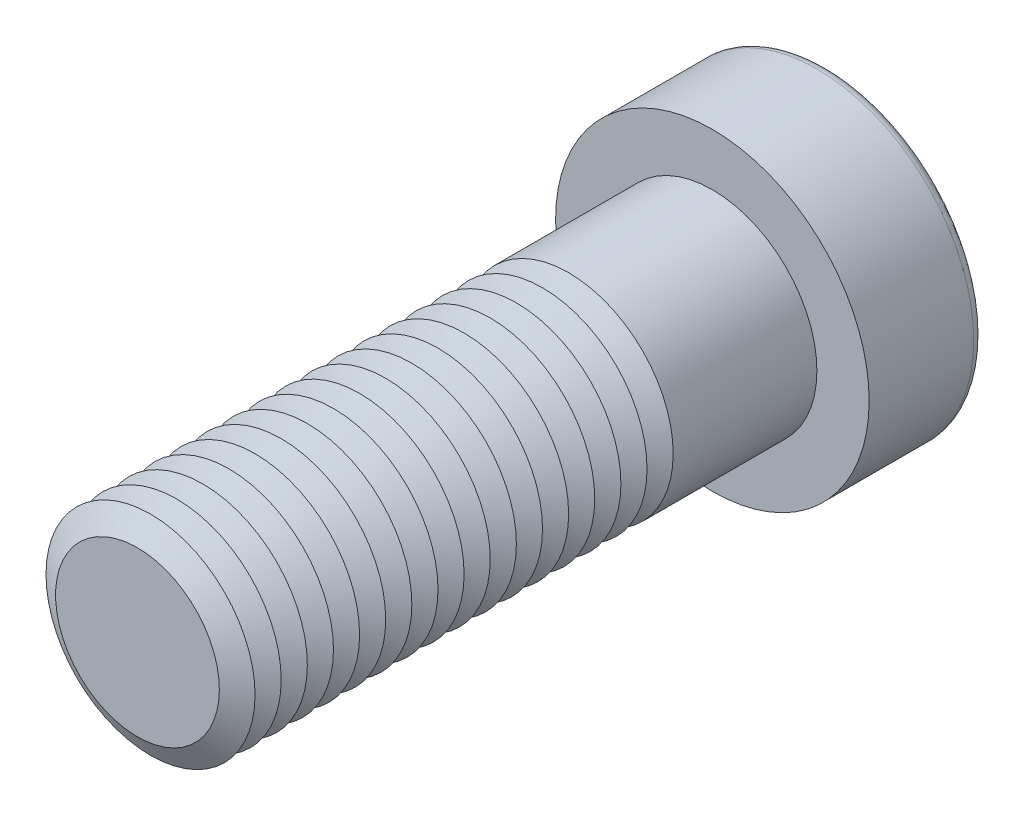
ISO-10303-21;
HEADER;
FILE_DESCRIPTION(('STEP AP214'),'2;1');
FILE_NAME('part.step','',(''),(''),'','','');
FILE_SCHEMA(('AUTOMOTIVE_DESIGN { 1 0 10303 214 1 1 1 1 }'));
ENDSEC;
DATA;
#1=APPLICATION_CONTEXT('core data for automotive mechanical design processes');
#2=APPLICATION_PROTOCOL_DEFINITION('international standard','automotive_design',2000,#1);
#3=PRODUCT_CONTEXT('',#1,'mechanical');
#4=PRODUCT('Part','Part','',(#3));
#5=PRODUCT_RELATED_PRODUCT_CATEGORY('part','',(#4));
#6=PRODUCT_DEFINITION_FORMATION('','',#4);
#7=PRODUCT_DEFINITION_CONTEXT('part definition',#1,'design');
#8=PRODUCT_DEFINITION('design','',#6,#7);
#9=PRODUCT_DEFINITION_SHAPE('','',#8);
#10=(LENGTH_UNIT() NAMED_UNIT(*) SI_UNIT(.MILLI.,.METRE.));
#11=(NAMED_UNIT(*) PLANE_ANGLE_UNIT() SI_UNIT($,.RADIAN.));
#12=(NAMED_UNIT(*) SI_UNIT($,.STERADIAN.) SOLID_ANGLE_UNIT());
#13=UNCERTAINTY_MEASURE_WITH_UNIT(LENGTH_MEASURE(1.E-05),#10,'distance_accuracy_value','');
#14=(GEOMETRIC_REPRESENTATION_CONTEXT(3) GLOBAL_UNCERTAINTY_ASSIGNED_CONTEXT((#13)) GLOBAL_UNIT_ASSIGNED_CONTEXT((#10,
#11,#12)) REPRESENTATION_CONTEXT('',''));
#15=CARTESIAN_POINT('',(0.,0.,0.));
#16=DIRECTION('',(0.,0.,1.));
#17=DIRECTION('',(1.,0.,0.));
#18=AXIS2_PLACEMENT_3D('',#15,#16,#17);
#19=CARTESIAN_POINT('',(0.,0.,46.25));
#20=DIRECTION('',(0.,0.,1.));
#21=DIRECTION('',(1.,0.,0.));
#22=AXIS2_PLACEMENT_3D('',#19,#20,#21);
#23=CONICAL_SURFACE('',#22,10.,1.0471975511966);
#24=CARTESIAN_POINT('',(0.,0.,45.));
#25=DIRECTION('',(0.,0.,1.));
#26=DIRECTION('',(1.,0.,0.));
#27=AXIS2_PLACEMENT_3D('',#24,#25,#26);
#28=CIRCLE('',#27,7.8349364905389);
#29=CARTESIAN_POINT('',(7.8349364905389,0.,45.));
#30=VERTEX_POINT('',#29);
#31=EDGE_CURVE('E314',#30,#30,#28,.T.);
#32=ORIENTED_EDGE('',*,*,#31,.T.);
#33=EDGE_LOOP('',(#32));
#34=FACE_BOUND('',#33,.T.);
#35=CARTESIAN_POINT('',(0.,0.,46.25));
#36=DIRECTION('',(0.,0.,1.));
#37=DIRECTION('',(1.,0.,0.));
#38=AXIS2_PLACEMENT_3D('',#35,#36,#37);
#39=CIRCLE('',#38,10.);
#40=CARTESIAN_POINT('',(10.,0.,46.25));
#41=VERTEX_POINT('',#40);
#42=EDGE_CURVE('E317',#41,#41,#39,.T.);
#43=ORIENTED_EDGE('',*,*,#42,.F.);
#44=EDGE_LOOP('',(#43));
#45=FACE_BOUND('',#44,.T.);
#46=ADVANCED_FACE('F39',(#34,#45),#23,.T.);
#47=CARTESIAN_POINT('',(0.,0.,45.));
#48=DIRECTION('',(0.,0.,-1.));
#49=DIRECTION('',(-1.,0.,0.));
#50=AXIS2_PLACEMENT_3D('',#47,#48,#49);
#51=CONICAL_SURFACE('',#50,7.8349364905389,1.0471975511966);
#52=CARTESIAN_POINT('',(0.,0.,43.75));
#53=DIRECTION('',(0.,0.,1.));
#54=DIRECTION('',(1.,0.,0.));
#55=AXIS2_PLACEMENT_3D('',#52,#53,#54);
#56=CIRCLE('',#55,10.);
#57=CARTESIAN_POINT('',(10.,0.,43.75));
#58=VERTEX_POINT('',#57);
#59=EDGE_CURVE('E325',#58,#58,#56,.T.);
#60=ORIENTED_EDGE('',*,*,#59,.T.);
#61=EDGE_LOOP('',(#60));
#62=FACE_BOUND('',#61,.T.);
#63=ORIENTED_EDGE('',*,*,#31,.F.);
#64=EDGE_LOOP('',(#63));
#65=FACE_BOUND('',#64,.T.);
#66=ADVANCED_FACE('F245',(#62,#65),#51,.T.);
#67=CARTESIAN_POINT('',(0.,0.,55.));
#68=DIRECTION('',(0.,0.,1.));
#69=DIRECTION('',(1.,0.,0.));
#70=AXIS2_PLACEMENT_3D('',#67,#68,#69);
#71=PLANE('',#70);
#72=CARTESIAN_POINT('',(0.,0.,55.));
#73=DIRECTION('',(0.,0.,1.));
#74=DIRECTION('',(1.,0.,0.));
#75=AXIS2_PLACEMENT_3D('',#72,#73,#74);
#76=CIRCLE('',#75,7.8349364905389);
#77=CARTESIAN_POINT('',(7.8349364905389,0.,55.));
#78=VERTEX_POINT('',#77);
#79=EDGE_CURVE('E174',#78,#78,#76,.T.);
#80=ORIENTED_EDGE('',*,*,#79,.T.);
#81=EDGE_LOOP('',(#80));
#82=FACE_BOUND('',#81,.T.);
#83=ADVANCED_FACE('F251',(#82),#71,.T.);
#84=CARTESIAN_POINT('',(0.,0.,55.));
#85=DIRECTION('',(0.,0.,-1.));
#86=DIRECTION('',(-1.,0.,0.));
#87=AXIS2_PLACEMENT_3D('',#84,#85,#86);
#88=CONICAL_SURFACE('',#87,7.8349364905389,1.0471975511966);
#89=CARTESIAN_POINT('',(0.,0.,53.75));
#90=DIRECTION('',(0.,0.,1.));
#91=DIRECTION('',(1.,0.,0.));
#92=AXIS2_PLACEMENT_3D('',#89,#90,#91);
#93=CIRCLE('',#92,10.);
#94=CARTESIAN_POINT('',(10.,0.,53.75));
#95=VERTEX_POINT('',#94);
#96=EDGE_CURVE('E291',#95,#95,#93,.T.);
#97=ORIENTED_EDGE('',*,*,#96,.T.);
#98=EDGE_LOOP('',(#97));
#99=FACE_BOUND('',#98,.T.);
#100=ORIENTED_EDGE('',*,*,#79,.F.);
#101=EDGE_LOOP('',(#100));
#102=FACE_BOUND('',#101,.T.);
#103=ADVANCED_FACE('F199',(#99,#102),#88,.T.);
#104=CARTESIAN_POINT('',(0.,0.,53.75));
#105=DIRECTION('',(0.,0.,1.));
#106=DIRECTION('',(1.,0.,0.));
#107=AXIS2_PLACEMENT_3D('',#104,#105,#106);
#108=CONICAL_SURFACE('',#107,10.,1.0471975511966);
#109=CARTESIAN_POINT('',(0.,0.,52.5));
#110=DIRECTION('',(0.,0.,1.));
#111=DIRECTION('',(1.,0.,0.));
#112=AXIS2_PLACEMENT_3D('',#109,#110,#111);
#113=CIRCLE('',#112,7.8349364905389);
#114=CARTESIAN_POINT('',(7.8349364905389,0.,52.5));
#115=VERTEX_POINT('',#114);
#116=EDGE_CURVE('E288',#115,#115,#113,.T.);
#117=ORIENTED_EDGE('',*,*,#116,.T.);
#118=EDGE_LOOP('',(#117));
#119=FACE_BOUND('',#118,.T.);
#120=ORIENTED_EDGE('',*,*,#96,.F.);
#121=EDGE_LOOP('',(#120));
#122=FACE_BOUND('',#121,.T.);
#123=ADVANCED_FACE('F277',(#119,#122),#108,.T.);
#124=CARTESIAN_POINT('',(0.,0.,52.5));
#125=DIRECTION('',(0.,0.,-1.));
#126=DIRECTION('',(-1.,0.,0.));
#127=AXIS2_PLACEMENT_3D('',#124,#125,#126);
#128=CONICAL_SURFACE('',#127,7.8349364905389,1.0471975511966);
#129=CARTESIAN_POINT('',(0.,0.,51.25));
#130=DIRECTION('',(0.,0.,1.));
#131=DIRECTION('',(1.,0.,0.));
#132=AXIS2_PLACEMENT_3D('',#129,#130,#131);
#133=CIRCLE('',#132,10.);
#134=CARTESIAN_POINT('',(10.,0.,51.25));
#135=VERTEX_POINT('',#134);
#136=EDGE_CURVE('E300',#135,#135,#133,.T.);
#137=ORIENTED_EDGE('',*,*,#136,.T.);
#138=EDGE_LOOP('',(#137));
#139=FACE_BOUND('',#138,.T.);
#140=ORIENTED_EDGE('',*,*,#116,.F.);
#141=EDGE_LOOP('',(#140));
#142=FACE_BOUND('',#141,.T.);
#143=ADVANCED_FACE('F274',(#139,#142),#128,.T.);
#144=CARTESIAN_POINT('',(0.,0.,51.25));
#145=DIRECTION('',(0.,0.,1.));
#146=DIRECTION('',(1.,0.,0.));
#147=AXIS2_PLACEMENT_3D('',#144,#145,#146);
#148=CONICAL_SURFACE('',#147,10.,1.0471975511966);
#149=CARTESIAN_POINT('',(0.,0.,50.));
#150=DIRECTION('',(0.,0.,1.));
#151=DIRECTION('',(1.,0.,0.));
#152=AXIS2_PLACEMENT_3D('',#149,#150,#151);
#153=CIRCLE('',#152,7.8349364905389);
#154=CARTESIAN_POINT('',(7.8349364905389,0.,50.));
#155=VERTEX_POINT('',#154);
#156=EDGE_CURVE('E293',#155,#155,#153,.T.);
#157=ORIENTED_EDGE('',*,*,#156,.T.);
#158=EDGE_LOOP('',(#157));
#159=FACE_BOUND('',#158,.T.);
#160=ORIENTED_EDGE('',*,*,#136,.F.);
#161=EDGE_LOOP('',(#160));
#162=FACE_BOUND('',#161,.T.);
#163=ADVANCED_FACE('F270',(#159,#162),#148,.T.);
#164=CARTESIAN_POINT('',(0.,0.,50.));
#165=DIRECTION('',(0.,0.,-1.));
#166=DIRECTION('',(-1.,0.,0.));
#167=AXIS2_PLACEMENT_3D('',#164,#165,#166);
#168=CONICAL_SURFACE('',#167,7.8349364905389,1.0471975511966);
#169=CARTESIAN_POINT('',(0.,0.,48.75));
#170=DIRECTION('',(0.,0.,1.));
#171=DIRECTION('',(1.,0.,0.));
#172=AXIS2_PLACEMENT_3D('',#169,#170,#171);
#173=CIRCLE('',#172,10.);
#174=CARTESIAN_POINT('',(10.,0.,48.75));
#175=VERTEX_POINT('',#174);
#176=EDGE_CURVE('E310',#175,#175,#173,.T.);
#177=ORIENTED_EDGE('',*,*,#176,.T.);
#178=EDGE_LOOP('',(#177));
#179=FACE_BOUND('',#178,.T.);
#180=ORIENTED_EDGE('',*,*,#156,.F.);
#181=EDGE_LOOP('',(#180));
#182=FACE_BOUND('',#181,.T.);
#183=ADVANCED_FACE('F266',(#179,#182),#168,.T.);
#184=CARTESIAN_POINT('',(0.,0.,48.75));
#185=DIRECTION('',(0.,0.,1.));
#186=DIRECTION('',(1.,0.,0.));
#187=AXIS2_PLACEMENT_3D('',#184,#185,#186);
#188=CONICAL_SURFACE('',#187,10.,1.0471975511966);
#189=CARTESIAN_POINT('',(0.,0.,47.5));
#190=DIRECTION('',(0.,0.,1.));
#191=DIRECTION('',(1.,0.,0.));
#192=AXIS2_PLACEMENT_3D('',#189,#190,#191);
#193=CIRCLE('',#192,7.8349364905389);
#194=CARTESIAN_POINT('',(7.8349364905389,0.,47.5));
#195=VERTEX_POINT('',#194);
#196=EDGE_CURVE('E306',#195,#195,#193,.T.);
#197=ORIENTED_EDGE('',*,*,#196,.T.);
#198=EDGE_LOOP('',(#197));
#199=FACE_BOUND('',#198,.T.);
#200=ORIENTED_EDGE('',*,*,#176,.F.);
#201=EDGE_LOOP('',(#200));
#202=FACE_BOUND('',#201,.T.);
#203=ADVANCED_FACE('F262',(#199,#202),#188,.T.);
#204=CARTESIAN_POINT('',(0.,0.,47.5));
#205=DIRECTION('',(0.,0.,-1.));
#206=DIRECTION('',(-1.,0.,0.));
#207=AXIS2_PLACEMENT_3D('',#204,#205,#206);
#208=CONICAL_SURFACE('',#207,7.8349364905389,1.0471975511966);
#209=ORIENTED_EDGE('',*,*,#42,.T.);
#210=EDGE_LOOP('',(#209));
#211=FACE_BOUND('',#210,.T.);
#212=ORIENTED_EDGE('',*,*,#196,.F.);
#213=EDGE_LOOP('',(#212));
#214=FACE_BOUND('',#213,.T.);
#215=ADVANCED_FACE('F258',(#211,#214),#208,.T.);
#216=CARTESIAN_POINT('',(0.,0.,43.75));
#217=DIRECTION('',(0.,0.,1.));
#218=DIRECTION('',(1.,0.,0.));
#219=AXIS2_PLACEMENT_3D('',#216,#217,#218);
#220=CONICAL_SURFACE('',#219,10.,1.0471975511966);
#221=CARTESIAN_POINT('',(0.,0.,42.5));
#222=DIRECTION('',(0.,0.,1.));
#223=DIRECTION('',(1.,0.,0.));
#224=AXIS2_PLACEMENT_3D('',#221,#222,#223);
#225=CIRCLE('',#224,7.8349364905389);
#226=CARTESIAN_POINT('',(7.8349364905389,0.,42.5));
#227=VERTEX_POINT('',#226);
#228=EDGE_CURVE('E321',#227,#227,#225,.T.);
#229=ORIENTED_EDGE('',*,*,#228,.T.);
#230=EDGE_LOOP('',(#229));
#231=FACE_BOUND('',#230,.T.);
#232=ORIENTED_EDGE('',*,*,#59,.F.);
#233=EDGE_LOOP('',(#232));
#234=FACE_BOUND('',#233,.T.);
#235=ADVANCED_FACE('F261',(#231,#234),#220,.T.);
#236=CARTESIAN_POINT('',(0.,0.,42.5));
#237=DIRECTION('',(0.,0.,-1.));
#238=DIRECTION('',(-1.,0.,0.));
#239=AXIS2_PLACEMENT_3D('',#236,#237,#238);
#240=CONICAL_SURFACE('',#239,7.8349364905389,1.0471975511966);
#241=CARTESIAN_POINT('',(0.,0.,41.25));
#242=DIRECTION('',(0.,0.,1.));
#243=DIRECTION('',(1.,0.,0.));
#244=AXIS2_PLACEMENT_3D('',#241,#242,#243);
#245=CIRCLE('',#244,10.);
#246=CARTESIAN_POINT('',(10.,0.,41.25));
#247=VERTEX_POINT('',#246);
#248=EDGE_CURVE('E333',#247,#247,#245,.T.);
#249=ORIENTED_EDGE('',*,*,#248,.T.);
#250=EDGE_LOOP('',(#249));
#251=FACE_BOUND('',#250,.T.);
#252=ORIENTED_EDGE('',*,*,#228,.F.);
#253=EDGE_LOOP('',(#252));
#254=FACE_BOUND('',#253,.T.);
#255=ADVANCED_FACE('F513',(#251,#254),#240,.T.);
#256=CARTESIAN_POINT('',(0.,0.,41.25));
#257=DIRECTION('',(0.,0.,1.));
#258=DIRECTION('',(1.,0.,0.));
#259=AXIS2_PLACEMENT_3D('',#256,#257,#258);
#260=CONICAL_SURFACE('',#259,10.,1.0471975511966);
#261=CARTESIAN_POINT('',(0.,0.,40.));
#262=DIRECTION('',(0.,0.,1.));
#263=DIRECTION('',(1.,0.,0.));
#264=AXIS2_PLACEMENT_3D('',#261,#262,#263);
#265=CIRCLE('',#264,7.8349364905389);
#266=CARTESIAN_POINT('',(7.8349364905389,0.,40.));
#267=VERTEX_POINT('',#266);
#268=EDGE_CURVE('E329',#267,#267,#265,.T.);
#269=ORIENTED_EDGE('',*,*,#268,.T.);
#270=EDGE_LOOP('',(#269));
#271=FACE_BOUND('',#270,.T.);
#272=ORIENTED_EDGE('',*,*,#248,.F.);
#273=EDGE_LOOP('',(#272));
#274=FACE_BOUND('',#273,.T.);
#275=ADVANCED_FACE('F509',(#271,#274),#260,.T.);
#276=CARTESIAN_POINT('',(0.,0.,40.));
#277=DIRECTION('',(0.,0.,-1.));
#278=DIRECTION('',(-1.,0.,0.));
#279=AXIS2_PLACEMENT_3D('',#276,#277,#278);
#280=CONICAL_SURFACE('',#279,7.8349364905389,1.0471975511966);
#281=CARTESIAN_POINT('',(0.,0.,38.75));
#282=DIRECTION('',(0.,0.,1.));
#283=DIRECTION('',(1.,0.,0.));
#284=AXIS2_PLACEMENT_3D('',#281,#282,#283);
#285=CIRCLE('',#284,10.);
#286=CARTESIAN_POINT('',(10.,0.,38.75));
#287=VERTEX_POINT('',#286);
#288=EDGE_CURVE('E341',#287,#287,#285,.T.);
#289=ORIENTED_EDGE('',*,*,#288,.T.);
#290=EDGE_LOOP('',(#289));
#291=FACE_BOUND('',#290,.T.);
#292=ORIENTED_EDGE('',*,*,#268,.F.);
#293=EDGE_LOOP('',(#292));
#294=FACE_BOUND('',#293,.T.);
#295=ADVANCED_FACE('F505',(#291,#294),#280,.T.);
#296=CARTESIAN_POINT('',(0.,0.,38.75));
#297=DIRECTION('',(0.,0.,1.));
#298=DIRECTION('',(1.,0.,0.));
#299=AXIS2_PLACEMENT_3D('',#296,#297,#298);
#300=CONICAL_SURFACE('',#299,10.,1.0471975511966);
#301=CARTESIAN_POINT('',(0.,0.,37.5));
#302=DIRECTION('',(0.,0.,1.));
#303=DIRECTION('',(1.,0.,0.));
#304=AXIS2_PLACEMENT_3D('',#301,#302,#303);
#305=CIRCLE('',#304,7.8349364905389);
#306=CARTESIAN_POINT('',(7.8349364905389,0.,37.5));
#307=VERTEX_POINT('',#306);
#308=EDGE_CURVE('E337',#307,#307,#305,.T.);
#309=ORIENTED_EDGE('',*,*,#308,.T.);
#310=EDGE_LOOP('',(#309));
#311=FACE_BOUND('',#310,.T.);
#312=ORIENTED_EDGE('',*,*,#288,.F.);
#313=EDGE_LOOP('',(#312));
#314=FACE_BOUND('',#313,.T.);
#315=ADVANCED_FACE('F501',(#311,#314),#300,.T.);
#316=CARTESIAN_POINT('',(0.,0.,37.5));
#317=DIRECTION('',(0.,0.,-1.));
#318=DIRECTION('',(-1.,0.,0.));
#319=AXIS2_PLACEMENT_3D('',#316,#317,#318);
#320=CONICAL_SURFACE('',#319,7.8349364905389,1.0471975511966);
#321=CARTESIAN_POINT('',(0.,0.,36.25));
#322=DIRECTION('',(0.,0.,1.));
#323=DIRECTION('',(1.,0.,0.));
#324=AXIS2_PLACEMENT_3D('',#321,#322,#323);
#325=CIRCLE('',#324,10.);
#326=CARTESIAN_POINT('',(10.,0.,36.25));
#327=VERTEX_POINT('',#326);
#328=EDGE_CURVE('E349',#327,#327,#325,.T.);
#329=ORIENTED_EDGE('',*,*,#328,.T.);
#330=EDGE_LOOP('',(#329));
#331=FACE_BOUND('',#330,.T.);
#332=ORIENTED_EDGE('',*,*,#308,.F.);
#333=EDGE_LOOP('',(#332));
#334=FACE_BOUND('',#333,.T.);
#335=ADVANCED_FACE('F497',(#331,#334),#320,.T.);
#336=CARTESIAN_POINT('',(0.,0.,36.25));
#337=DIRECTION('',(0.,0.,1.));
#338=DIRECTION('',(1.,0.,0.));
#339=AXIS2_PLACEMENT_3D('',#336,#337,#338);
#340=CONICAL_SURFACE('',#339,10.,1.0471975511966);
#341=CARTESIAN_POINT('',(0.,0.,35.));
#342=DIRECTION('',(0.,0.,1.));
#343=DIRECTION('',(1.,0.,0.));
#344=AXIS2_PLACEMENT_3D('',#341,#342,#343);
#345=CIRCLE('',#344,7.8349364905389);
#346=CARTESIAN_POINT('',(7.8349364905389,0.,35.));
#347=VERTEX_POINT('',#346);
#348=EDGE_CURVE('E345',#347,#347,#345,.T.);
#349=ORIENTED_EDGE('',*,*,#348,.T.);
#350=EDGE_LOOP('',(#349));
#351=FACE_BOUND('',#350,.T.);
#352=ORIENTED_EDGE('',*,*,#328,.F.);
#353=EDGE_LOOP('',(#352));
#354=FACE_BOUND('',#353,.T.);
#355=ADVANCED_FACE('F493',(#351,#354),#340,.T.);
#356=CARTESIAN_POINT('',(0.,0.,35.));
#357=DIRECTION('',(0.,0.,-1.));
#358=DIRECTION('',(-1.,0.,0.));
#359=AXIS2_PLACEMENT_3D('',#356,#357,#358);
#360=CONICAL_SURFACE('',#359,7.8349364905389,1.0471975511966);
#361=CARTESIAN_POINT('',(0.,0.,33.75));
#362=DIRECTION('',(0.,0.,1.));
#363=DIRECTION('',(1.,0.,0.));
#364=AXIS2_PLACEMENT_3D('',#361,#362,#363);
#365=CIRCLE('',#364,10.);
#366=CARTESIAN_POINT('',(10.,0.,33.75));
#367=VERTEX_POINT('',#366);
#368=EDGE_CURVE('E357',#367,#367,#365,.T.);
#369=ORIENTED_EDGE('',*,*,#368,.T.);
#370=EDGE_LOOP('',(#369));
#371=FACE_BOUND('',#370,.T.);
#372=ORIENTED_EDGE('',*,*,#348,.F.);
#373=EDGE_LOOP('',(#372));
#374=FACE_BOUND('',#373,.T.);
#375=ADVANCED_FACE('F489',(#371,#374),#360,.T.);
#376=CARTESIAN_POINT('',(0.,0.,33.75));
#377=DIRECTION('',(0.,0.,1.));
#378=DIRECTION('',(1.,0.,0.));
#379=AXIS2_PLACEMENT_3D('',#376,#377,#378);
#380=CONICAL_SURFACE('',#379,10.,1.0471975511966);
#381=CARTESIAN_POINT('',(0.,0.,32.5));
#382=DIRECTION('',(0.,0.,1.));
#383=DIRECTION('',(1.,0.,0.));
#384=AXIS2_PLACEMENT_3D('',#381,#382,#383);
#385=CIRCLE('',#384,7.8349364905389);
#386=CARTESIAN_POINT('',(7.8349364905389,0.,32.5));
#387=VERTEX_POINT('',#386);
#388=EDGE_CURVE('E353',#387,#387,#385,.T.);
#389=ORIENTED_EDGE('',*,*,#388,.T.);
#390=EDGE_LOOP('',(#389));
#391=FACE_BOUND('',#390,.T.);
#392=ORIENTED_EDGE('',*,*,#368,.F.);
#393=EDGE_LOOP('',(#392));
#394=FACE_BOUND('',#393,.T.);
#395=ADVANCED_FACE('F485',(#391,#394),#380,.T.);
#396=CARTESIAN_POINT('',(0.,0.,32.5));
#397=DIRECTION('',(0.,0.,-1.));
#398=DIRECTION('',(-1.,0.,0.));
#399=AXIS2_PLACEMENT_3D('',#396,#397,#398);
#400=CONICAL_SURFACE('',#399,7.8349364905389,1.0471975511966);
#401=CARTESIAN_POINT('',(0.,0.,31.25));
#402=DIRECTION('',(0.,0.,1.));
#403=DIRECTION('',(1.,0.,0.));
#404=AXIS2_PLACEMENT_3D('',#401,#402,#403);
#405=CIRCLE('',#404,10.);
#406=CARTESIAN_POINT('',(10.,0.,31.25));
#407=VERTEX_POINT('',#406);
#408=EDGE_CURVE('E365',#407,#407,#405,.T.);
#409=ORIENTED_EDGE('',*,*,#408,.T.);
#410=EDGE_LOOP('',(#409));
#411=FACE_BOUND('',#410,.T.);
#412=ORIENTED_EDGE('',*,*,#388,.F.);
#413=EDGE_LOOP('',(#412));
#414=FACE_BOUND('',#413,.T.);
#415=ADVANCED_FACE('F481',(#411,#414),#400,.T.);
#416=CARTESIAN_POINT('',(0.,0.,31.25));
#417=DIRECTION('',(0.,0.,1.));
#418=DIRECTION('',(1.,0.,0.));
#419=AXIS2_PLACEMENT_3D('',#416,#417,#418);
#420=CONICAL_SURFACE('',#419,10.,1.0471975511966);
#421=CARTESIAN_POINT('',(0.,0.,30.));
#422=DIRECTION('',(0.,0.,1.));
#423=DIRECTION('',(1.,0.,0.));
#424=AXIS2_PLACEMENT_3D('',#421,#422,#423);
#425=CIRCLE('',#424,7.8349364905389);
#426=CARTESIAN_POINT('',(7.8349364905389,0.,30.));
#427=VERTEX_POINT('',#426);
#428=EDGE_CURVE('E361',#427,#427,#425,.T.);
#429=ORIENTED_EDGE('',*,*,#428,.T.);
#430=EDGE_LOOP('',(#429));
#431=FACE_BOUND('',#430,.T.);
#432=ORIENTED_EDGE('',*,*,#408,.F.);
#433=EDGE_LOOP('',(#432));
#434=FACE_BOUND('',#433,.T.);
#435=ADVANCED_FACE('F477',(#431,#434),#420,.T.);
#436=CARTESIAN_POINT('',(0.,0.,30.));
#437=DIRECTION('',(0.,0.,-1.));
#438=DIRECTION('',(-1.,0.,0.));
#439=AXIS2_PLACEMENT_3D('',#436,#437,#438);
#440=CONICAL_SURFACE('',#439,7.8349364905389,1.0471975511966);
#441=CARTESIAN_POINT('',(0.,0.,28.75));
#442=DIRECTION('',(0.,0.,1.));
#443=DIRECTION('',(1.,0.,0.));
#444=AXIS2_PLACEMENT_3D('',#441,#442,#443);
#445=CIRCLE('',#444,10.);
#446=CARTESIAN_POINT('',(10.,0.,28.75));
#447=VERTEX_POINT('',#446);
#448=EDGE_CURVE('E373',#447,#447,#445,.T.);
#449=ORIENTED_EDGE('',*,*,#448,.T.);
#450=EDGE_LOOP('',(#449));
#451=FACE_BOUND('',#450,.T.);
#452=ORIENTED_EDGE('',*,*,#428,.F.);
#453=EDGE_LOOP('',(#452));
#454=FACE_BOUND('',#453,.T.);
#455=ADVANCED_FACE('F473',(#451,#454),#440,.T.);
#456=CARTESIAN_POINT('',(0.,0.,28.75));
#457=DIRECTION('',(0.,0.,1.));
#458=DIRECTION('',(1.,0.,0.));
#459=AXIS2_PLACEMENT_3D('',#456,#457,#458);
#460=CONICAL_SURFACE('',#459,10.,1.0471975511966);
#461=CARTESIAN_POINT('',(0.,0.,27.5));
#462=DIRECTION('',(0.,0.,1.));
#463=DIRECTION('',(1.,0.,0.));
#464=AXIS2_PLACEMENT_3D('',#461,#462,#463);
#465=CIRCLE('',#464,7.8349364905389);
#466=CARTESIAN_POINT('',(7.8349364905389,0.,27.5));
#467=VERTEX_POINT('',#466);
#468=EDGE_CURVE('E369',#467,#467,#465,.T.);
#469=ORIENTED_EDGE('',*,*,#468,.T.);
#470=EDGE_LOOP('',(#469));
#471=FACE_BOUND('',#470,.T.);
#472=ORIENTED_EDGE('',*,*,#448,.F.);
#473=EDGE_LOOP('',(#472));
#474=FACE_BOUND('',#473,.T.);
#475=ADVANCED_FACE('F469',(#471,#474),#460,.T.);
#476=CARTESIAN_POINT('',(0.,0.,27.5));
#477=DIRECTION('',(0.,0.,-1.));
#478=DIRECTION('',(-1.,0.,0.));
#479=AXIS2_PLACEMENT_3D('',#476,#477,#478);
#480=CONICAL_SURFACE('',#479,7.8349364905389,1.0471975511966);
#481=CARTESIAN_POINT('',(0.,0.,26.25));
#482=DIRECTION('',(0.,0.,1.));
#483=DIRECTION('',(1.,0.,0.));
#484=AXIS2_PLACEMENT_3D('',#481,#482,#483);
#485=CIRCLE('',#484,10.);
#486=CARTESIAN_POINT('',(10.,0.,26.25));
#487=VERTEX_POINT('',#486);
#488=EDGE_CURVE('E380',#487,#487,#485,.T.);
#489=ORIENTED_EDGE('',*,*,#488,.T.);
#490=EDGE_LOOP('',(#489));
#491=FACE_BOUND('',#490,.T.);
#492=ORIENTED_EDGE('',*,*,#468,.F.);
#493=EDGE_LOOP('',(#492));
#494=FACE_BOUND('',#493,.T.);
#495=ADVANCED_FACE('F465',(#491,#494),#480,.T.);
#496=CARTESIAN_POINT('',(0.,0.,26.25));
#497=DIRECTION('',(0.,0.,1.));
#498=DIRECTION('',(1.,0.,0.));
#499=AXIS2_PLACEMENT_3D('',#496,#497,#498);
#500=CONICAL_SURFACE('',#499,10.,1.0471975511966);
#501=CARTESIAN_POINT('',(0.,0.,25.));
#502=DIRECTION('',(0.,0.,1.));
#503=DIRECTION('',(1.,0.,0.));
#504=AXIS2_PLACEMENT_3D('',#501,#502,#503);
#505=CIRCLE('',#504,7.8349364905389);
#506=CARTESIAN_POINT('',(7.8349364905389,0.,25.));
#507=VERTEX_POINT('',#506);
#508=EDGE_CURVE('E377',#507,#507,#505,.T.);
#509=ORIENTED_EDGE('',*,*,#508,.T.);
#510=EDGE_LOOP('',(#509));
#511=FACE_BOUND('',#510,.T.);
#512=ORIENTED_EDGE('',*,*,#488,.F.);
#513=EDGE_LOOP('',(#512));
#514=FACE_BOUND('',#513,.T.);
#515=ADVANCED_FACE('F461',(#511,#514),#500,.T.);
#516=CARTESIAN_POINT('',(0.,0.,25.));
#517=DIRECTION('',(0.,0.,-1.));
#518=DIRECTION('',(-1.,0.,0.));
#519=AXIS2_PLACEMENT_3D('',#516,#517,#518);
#520=CONICAL_SURFACE('',#519,7.8349364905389,1.0471975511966);
#521=CARTESIAN_POINT('',(0.,0.,23.75));
#522=DIRECTION('',(0.,0.,1.));
#523=DIRECTION('',(1.,0.,0.));
#524=AXIS2_PLACEMENT_3D('',#521,#522,#523);
#525=CIRCLE('',#524,10.);
#526=CARTESIAN_POINT('',(10.,0.,23.75));
#527=VERTEX_POINT('',#526);
#528=EDGE_CURVE('E388',#527,#527,#525,.T.);
#529=ORIENTED_EDGE('',*,*,#528,.T.);
#530=EDGE_LOOP('',(#529));
#531=FACE_BOUND('',#530,.T.);
#532=ORIENTED_EDGE('',*,*,#508,.F.);
#533=EDGE_LOOP('',(#532));
#534=FACE_BOUND('',#533,.T.);
#535=ADVANCED_FACE('F457',(#531,#534),#520,.T.);
#536=CARTESIAN_POINT('',(0.,0.,23.75));
#537=DIRECTION('',(0.,0.,1.));
#538=DIRECTION('',(1.,0.,0.));
#539=AXIS2_PLACEMENT_3D('',#536,#537,#538);
#540=CONICAL_SURFACE('',#539,10.,1.0471975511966);
#541=CARTESIAN_POINT('',(0.,0.,22.5));
#542=DIRECTION('',(0.,0.,1.));
#543=DIRECTION('',(1.,0.,0.));
#544=AXIS2_PLACEMENT_3D('',#541,#542,#543);
#545=CIRCLE('',#544,7.8349364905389);
#546=CARTESIAN_POINT('',(7.8349364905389,0.,22.5));
#547=VERTEX_POINT('',#546);
#548=EDGE_CURVE('E384',#547,#547,#545,.T.);
#549=ORIENTED_EDGE('',*,*,#548,.T.);
#550=EDGE_LOOP('',(#549));
#551=FACE_BOUND('',#550,.T.);
#552=ORIENTED_EDGE('',*,*,#528,.F.);
#553=EDGE_LOOP('',(#552));
#554=FACE_BOUND('',#553,.T.);
#555=ADVANCED_FACE('F453',(#551,#554),#540,.T.);
#556=CARTESIAN_POINT('',(0.,0.,22.5));
#557=DIRECTION('',(0.,0.,-1.));
#558=DIRECTION('',(-1.,0.,0.));
#559=AXIS2_PLACEMENT_3D('',#556,#557,#558);
#560=CONICAL_SURFACE('',#559,7.8349364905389,1.0471975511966);
#561=CARTESIAN_POINT('',(0.,0.,21.25));
#562=DIRECTION('',(0.,0.,1.));
#563=DIRECTION('',(1.,0.,0.));
#564=AXIS2_PLACEMENT_3D('',#561,#562,#563);
#565=CIRCLE('',#564,10.);
#566=CARTESIAN_POINT('',(10.,0.,21.25));
#567=VERTEX_POINT('',#566);
#568=EDGE_CURVE('E396',#567,#567,#565,.T.);
#569=ORIENTED_EDGE('',*,*,#568,.T.);
#570=EDGE_LOOP('',(#569));
#571=FACE_BOUND('',#570,.T.);
#572=ORIENTED_EDGE('',*,*,#548,.F.);
#573=EDGE_LOOP('',(#572));
#574=FACE_BOUND('',#573,.T.);
#575=ADVANCED_FACE('F449',(#571,#574),#560,.T.);
#576=CARTESIAN_POINT('',(0.,0.,21.25));
#577=DIRECTION('',(0.,0.,1.));
#578=DIRECTION('',(1.,0.,0.));
#579=AXIS2_PLACEMENT_3D('',#576,#577,#578);
#580=CONICAL_SURFACE('',#579,10.,1.0471975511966);
#581=CARTESIAN_POINT('',(0.,0.,20.));
#582=DIRECTION('',(0.,0.,1.));
#583=DIRECTION('',(1.,0.,0.));
#584=AXIS2_PLACEMENT_3D('',#581,#582,#583);
#585=CIRCLE('',#584,7.8349364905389);
#586=CARTESIAN_POINT('',(7.8349364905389,0.,20.));
#587=VERTEX_POINT('',#586);
#588=EDGE_CURVE('E392',#587,#587,#585,.T.);
#589=ORIENTED_EDGE('',*,*,#588,.T.);
#590=EDGE_LOOP('',(#589));
#591=FACE_BOUND('',#590,.T.);
#592=ORIENTED_EDGE('',*,*,#568,.F.);
#593=EDGE_LOOP('',(#592));
#594=FACE_BOUND('',#593,.T.);
#595=ADVANCED_FACE('F445',(#591,#594),#580,.T.);
#596=CARTESIAN_POINT('',(0.,0.,20.));
#597=DIRECTION('',(0.,0.,-1.));
#598=DIRECTION('',(-1.,0.,0.));
#599=AXIS2_PLACEMENT_3D('',#596,#597,#598);
#600=CONICAL_SURFACE('',#599,7.8349364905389,1.0471975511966);
#601=CARTESIAN_POINT('',(0.,0.,18.75));
#602=DIRECTION('',(0.,0.,1.));
#603=DIRECTION('',(1.,0.,0.));
#604=AXIS2_PLACEMENT_3D('',#601,#602,#603);
#605=CIRCLE('',#604,10.);
#606=CARTESIAN_POINT('',(10.,0.,18.75));
#607=VERTEX_POINT('',#606);
#608=EDGE_CURVE('E404',#607,#607,#605,.T.);
#609=ORIENTED_EDGE('',*,*,#608,.T.);
#610=EDGE_LOOP('',(#609));
#611=FACE_BOUND('',#610,.T.);
#612=ORIENTED_EDGE('',*,*,#588,.F.);
#613=EDGE_LOOP('',(#612));
#614=FACE_BOUND('',#613,.T.);
#615=ADVANCED_FACE('F441',(#611,#614),#600,.T.);
#616=CARTESIAN_POINT('',(0.,0.,18.75));
#617=DIRECTION('',(0.,0.,1.));
#618=DIRECTION('',(1.,0.,0.));
#619=AXIS2_PLACEMENT_3D('',#616,#617,#618);
#620=CONICAL_SURFACE('',#619,10.,1.0471975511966);
#621=CARTESIAN_POINT('',(0.,0.,17.5));
#622=DIRECTION('',(0.,0.,1.));
#623=DIRECTION('',(1.,0.,0.));
#624=AXIS2_PLACEMENT_3D('',#621,#622,#623);
#625=CIRCLE('',#624,7.8349364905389);
#626=CARTESIAN_POINT('',(7.8349364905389,0.,17.5));
#627=VERTEX_POINT('',#626);
#628=EDGE_CURVE('E400',#627,#627,#625,.T.);
#629=ORIENTED_EDGE('',*,*,#628,.T.);
#630=EDGE_LOOP('',(#629));
#631=FACE_BOUND('',#630,.T.);
#632=ORIENTED_EDGE('',*,*,#608,.F.);
#633=EDGE_LOOP('',(#632));
#634=FACE_BOUND('',#633,.T.);
#635=ADVANCED_FACE('F436',(#631,#634),#620,.T.);
#636=CARTESIAN_POINT('',(0.,0.,17.5));
#637=DIRECTION('',(0.,0.,-1.));
#638=DIRECTION('',(-1.,0.,0.));
#639=AXIS2_PLACEMENT_3D('',#636,#637,#638);
#640=CONICAL_SURFACE('',#639,7.8349364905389,1.0471975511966);
#641=CARTESIAN_POINT('',(0.,0.,16.25));
#642=DIRECTION('',(0.,0.,1.));
#643=DIRECTION('',(1.,0.,0.));
#644=AXIS2_PLACEMENT_3D('',#641,#642,#643);
#645=CIRCLE('',#644,10.);
#646=CARTESIAN_POINT('',(10.,0.,16.25));
#647=VERTEX_POINT('',#646);
#648=EDGE_CURVE('E416',#647,#647,#645,.T.);
#649=ORIENTED_EDGE('',*,*,#648,.T.);
#650=EDGE_LOOP('',(#649));
#651=FACE_BOUND('',#650,.T.);
#652=ORIENTED_EDGE('',*,*,#628,.F.);
#653=EDGE_LOOP('',(#652));
#654=FACE_BOUND('',#653,.T.);
#655=ADVANCED_FACE('F422',(#651,#654),#640,.T.);
#656=CARTESIAN_POINT('',(0.,0.,16.25));
#657=DIRECTION('',(0.,0.,1.));
#658=DIRECTION('',(1.,0.,0.));
#659=AXIS2_PLACEMENT_3D('',#656,#657,#658);
#660=CONICAL_SURFACE('',#659,10.,1.0471975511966);
#661=CARTESIAN_POINT('',(0.,0.,15.));
#662=DIRECTION('',(0.,0.,1.));
#663=DIRECTION('',(1.,0.,0.));
#664=AXIS2_PLACEMENT_3D('',#661,#662,#663);
#665=CIRCLE('',#664,7.8349364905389);
#666=CARTESIAN_POINT('',(7.8349364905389,0.,15.));
#667=VERTEX_POINT('',#666);
#668=EDGE_CURVE('E408',#667,#667,#665,.T.);
#669=ORIENTED_EDGE('',*,*,#668,.T.);
#670=EDGE_LOOP('',(#669));
#671=FACE_BOUND('',#670,.T.);
#672=ORIENTED_EDGE('',*,*,#648,.F.);
#673=EDGE_LOOP('',(#672));
#674=FACE_BOUND('',#673,.T.);
#675=ADVANCED_FACE('F425',(#671,#674),#660,.T.);
#676=CARTESIAN_POINT('',(0.,0.,15.));
#677=DIRECTION('',(0.,0.,-1.));
#678=DIRECTION('',(-1.,0.,0.));
#679=AXIS2_PLACEMENT_3D('',#676,#677,#678);
#680=CONICAL_SURFACE('',#679,7.8349364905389,1.0471975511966);
#681=CARTESIAN_POINT('',(0.,0.,13.75));
#682=DIRECTION('',(0.,0.,1.));
#683=DIRECTION('',(1.,0.,0.));
#684=AXIS2_PLACEMENT_3D('',#681,#682,#683);
#685=CIRCLE('',#684,10.);
#686=CARTESIAN_POINT('',(10.,0.,13.75));
#687=VERTEX_POINT('',#686);
#688=EDGE_CURVE('E412',#687,#687,#685,.T.);
#689=ORIENTED_EDGE('',*,*,#688,.T.);
#690=EDGE_LOOP('',(#689));
#691=FACE_BOUND('',#690,.T.);
#692=ORIENTED_EDGE('',*,*,#668,.F.);
#693=EDGE_LOOP('',(#692));
#694=FACE_BOUND('',#693,.T.);
#695=ADVANCED_FACE('F427',(#691,#694),#680,.T.);
#696=CARTESIAN_POINT('',(0.,0.,-0.499999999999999));
#697=DIRECTION('',(0.,0.,-1.));
#698=DIRECTION('',(-1.,0.,0.));
#699=AXIS2_PLACEMENT_3D('',#696,#697,#698);
#700=CONICAL_SURFACE('',#699,7.,1.0471975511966);
#701=CARTESIAN_POINT('',(0.,0.,3.54145188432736));
#702=VERTEX_POINT('',#701);
#703=VERTEX_LOOP('',#702);
#704=FACE_BOUND('',#703,.T.);
#705=CARTESIAN_POINT('',(0.,0.,-0.499999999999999));
#706=DIRECTION('',(0.,0.,-1.));
#707=DIRECTION('',(-1.,0.,0.));
#708=AXIS2_PLACEMENT_3D('',#705,#706,#707);
#709=CIRCLE('',#708,7.);
#710=CARTESIAN_POINT('',(-6.06217782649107,3.5,-0.499999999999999));
#711=VERTEX_POINT('',#710);
#712=CARTESIAN_POINT('',(0.,7.,-0.499999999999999));
#713=VERTEX_POINT('',#712);
#714=EDGE_CURVE('E149',#711,#713,#709,.T.);
#715=ORIENTED_EDGE('',*,*,#714,.T.);
#716=CARTESIAN_POINT('',(0.,0.,-0.499999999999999));
#717=DIRECTION('',(0.,0.,-1.));
#718=DIRECTION('',(-1.,0.,0.));
#719=AXIS2_PLACEMENT_3D('',#716,#717,#718);
#720=CIRCLE('',#719,7.);
#721=CARTESIAN_POINT('',(6.06217782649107,3.5,-0.499999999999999));
#722=VERTEX_POINT('',#721);
#723=EDGE_CURVE('E54',#713,#722,#720,.T.);
#724=ORIENTED_EDGE('',*,*,#723,.T.);
#725=CARTESIAN_POINT('',(6.06217782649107,-3.5,-0.499999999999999));
#726=VERTEX_POINT('',#725);
#727=EDGE_CURVE('E1026',#722,#726,#720,.T.);
#728=ORIENTED_EDGE('',*,*,#727,.T.);
#729=CARTESIAN_POINT('',(0.,-7.,-0.499999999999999));
#730=VERTEX_POINT('',#729);
#731=EDGE_CURVE('E1024',#726,#730,#720,.T.);
#732=ORIENTED_EDGE('',*,*,#731,.T.);
#733=CARTESIAN_POINT('',(-6.06217782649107,-3.5,-0.499999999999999));
#734=VERTEX_POINT('',#733);
#735=EDGE_CURVE('E1019',#730,#734,#720,.T.);
#736=ORIENTED_EDGE('',*,*,#735,.T.);
#737=EDGE_CURVE('E1018',#734,#711,#720,.T.);
#738=ORIENTED_EDGE('',*,*,#737,.T.);
#739=EDGE_LOOP('',(#715,#724,#728,#732,#736,#738));
#740=FACE_BOUND('',#739,.T.);
#741=ADVANCED_FACE('F201',(#704,#740),#700,.F.);
#742=CARTESIAN_POINT('',(0.,0.,-0.499999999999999));
#743=DIRECTION('',(0.,0.,-1.));
#744=DIRECTION('',(-1.,0.,0.));
#745=AXIS2_PLACEMENT_3D('',#742,#743,#744);
#746=PLANE('',#745);
#747=ORIENTED_EDGE('',*,*,#723,.F.);
#748=DIRECTION('',(1.,0.,0.));
#749=VECTOR('',#748,1.);
#750=CARTESIAN_POINT('',(-4.04145188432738,7.,-0.499999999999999));
#751=LINE('',#750,#749);
#752=CARTESIAN_POINT('',(4.04145188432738,7.,-0.499999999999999));
#753=VERTEX_POINT('',#752);
#754=EDGE_CURVE('E1072',#713,#753,#751,.T.);
#755=ORIENTED_EDGE('',*,*,#754,.T.);
#756=DIRECTION('',(0.5,-0.866025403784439,0.));
#757=VECTOR('',#756,1.);
#758=CARTESIAN_POINT('',(4.04145188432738,7.,-0.499999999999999));
#759=LINE('',#758,#757);
#760=EDGE_CURVE('E155',#753,#722,#759,.T.);
#761=ORIENTED_EDGE('',*,*,#760,.T.);
#762=EDGE_LOOP('',(#747,#755,#761));
#763=FACE_BOUND('',#762,.T.);
#764=ADVANCED_FACE('F608',(#763),#746,.T.);
#765=ORIENTED_EDGE('',*,*,#727,.F.);
#766=CARTESIAN_POINT('',(8.08290376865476,0.,-0.499999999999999));
#767=VERTEX_POINT('',#766);
#768=EDGE_CURVE('E1064',#722,#767,#759,.T.);
#769=ORIENTED_EDGE('',*,*,#768,.T.);
#770=DIRECTION('',(-0.5,-0.866025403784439,0.));
#771=VECTOR('',#770,1.);
#772=CARTESIAN_POINT('',(8.08290376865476,0.,-0.499999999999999));
#773=LINE('',#772,#771);
#774=EDGE_CURVE('E1039',#767,#726,#773,.T.);
#775=ORIENTED_EDGE('',*,*,#774,.T.);
#776=EDGE_LOOP('',(#765,#769,#775));
#777=FACE_BOUND('',#776,.T.);
#778=ADVANCED_FACE('F618',(#777),#746,.T.);
#779=ORIENTED_EDGE('',*,*,#731,.F.);
#780=CARTESIAN_POINT('',(4.04145188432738,-7.,-0.499999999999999));
#781=VERTEX_POINT('',#780);
#782=EDGE_CURVE('E1041',#726,#781,#773,.T.);
#783=ORIENTED_EDGE('',*,*,#782,.T.);
#784=DIRECTION('',(-1.,0.,0.));
#785=VECTOR('',#784,1.);
#786=CARTESIAN_POINT('',(4.04145188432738,-7.,-0.499999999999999));
#787=LINE('',#786,#785);
#788=EDGE_CURVE('E991',#781,#730,#787,.T.);
#789=ORIENTED_EDGE('',*,*,#788,.T.);
#790=EDGE_LOOP('',(#779,#783,#789));
#791=FACE_BOUND('',#790,.T.);
#792=ADVANCED_FACE('F628',(#791),#746,.T.);
#793=ORIENTED_EDGE('',*,*,#735,.F.);
#794=CARTESIAN_POINT('',(-4.04145188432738,-7.,-0.499999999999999));
#795=VERTEX_POINT('',#794);
#796=EDGE_CURVE('E1036',#730,#795,#787,.T.);
#797=ORIENTED_EDGE('',*,*,#796,.T.);
#798=DIRECTION('',(-0.5,0.866025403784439,0.));
#799=VECTOR('',#798,1.);
#800=CARTESIAN_POINT('',(-4.04145188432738,-7.,-0.499999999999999));
#801=LINE('',#800,#799);
#802=EDGE_CURVE('E1038',#795,#734,#801,.T.);
#803=ORIENTED_EDGE('',*,*,#802,.T.);
#804=EDGE_LOOP('',(#793,#797,#803));
#805=FACE_BOUND('',#804,.T.);
#806=ADVANCED_FACE('F636',(#805),#746,.T.);
#807=ORIENTED_EDGE('',*,*,#737,.F.);
#808=CARTESIAN_POINT('',(-8.08290376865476,0.,-0.499999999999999));
#809=VERTEX_POINT('',#808);
#810=EDGE_CURVE('E1043',#734,#809,#801,.T.);
#811=ORIENTED_EDGE('',*,*,#810,.T.);
#812=DIRECTION('',(0.5,0.866025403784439,0.));
#813=VECTOR('',#812,1.);
#814=CARTESIAN_POINT('',(-8.08290376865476,0.,-0.499999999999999));
#815=LINE('',#814,#813);
#816=EDGE_CURVE('E158',#809,#711,#815,.T.);
#817=ORIENTED_EDGE('',*,*,#816,.T.);
#818=EDGE_LOOP('',(#807,#811,#817));
#819=FACE_BOUND('',#818,.T.);
#820=ADVANCED_FACE('F231',(#819),#746,.T.);
#821=ORIENTED_EDGE('',*,*,#714,.F.);
#822=CARTESIAN_POINT('',(-4.04145188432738,7.,-0.499999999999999));
#823=VERTEX_POINT('',#822);
#824=EDGE_CURVE('E1049',#711,#823,#815,.T.);
#825=ORIENTED_EDGE('',*,*,#824,.T.);
#826=EDGE_CURVE('E1065',#823,#713,#751,.T.);
#827=ORIENTED_EDGE('',*,*,#826,.T.);
#828=EDGE_LOOP('',(#821,#825,#827));
#829=FACE_BOUND('',#828,.T.);
#830=ADVANCED_FACE('F620',(#829),#746,.T.);
#831=CARTESIAN_POINT('',(-4.04145188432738,7.,-0.499999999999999));
#832=DIRECTION('',(0.,1.,0.));
#833=DIRECTION('',(0.,0.,1.));
#834=AXIS2_PLACEMENT_3D('',#831,#832,#833);
#835=PLANE('',#834);
#836=DIRECTION('',(0.,0.,-1.));
#837=VECTOR('',#836,1.);
#838=CARTESIAN_POINT('',(-4.04145188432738,7.,-0.499999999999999));
#839=LINE('',#838,#837);
#840=CARTESIAN_POINT('',(-4.04145188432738,7.,-11.));
#841=VERTEX_POINT('',#840);
#842=EDGE_CURVE('E147',#823,#841,#839,.T.);
#843=ORIENTED_EDGE('',*,*,#842,.T.);
#844=CARTESIAN_POINT('',(-10.5504265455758,7.,-12.226809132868));
#845=CARTESIAN_POINT('',(-10.234342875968,7.,-12.1562549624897));
#846=CARTESIAN_POINT('',(-9.91805751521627,7.,-12.0865877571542));
#847=CARTESIAN_POINT('',(-9.28498462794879,7.,-11.9495060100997));
#848=CARTESIAN_POINT('',(-8.9681970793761,7.,-11.8820915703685));
#849=CARTESIAN_POINT('',(-8.3337216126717,7.,-11.7499322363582));
#850=CARTESIAN_POINT('',(-8.0160331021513,7.,-11.6851901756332));
#851=CARTESIAN_POINT('',(-7.37998429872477,7.,-11.5590967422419));
#852=CARTESIAN_POINT('',(-7.0616240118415,7.,-11.4977453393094));
#853=CARTESIAN_POINT('',(-6.42688035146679,7.,-11.3797520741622));
#854=CARTESIAN_POINT('',(-6.11050373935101,7.,-11.3230740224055));
#855=CARTESIAN_POINT('',(-5.47688007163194,7.,-11.214821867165));
#856=CARTESIAN_POINT('',(-5.15963303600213,7.,-11.1632476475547));
#857=CARTESIAN_POINT('',(-4.52422055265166,7.,-11.0663930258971));
#858=CARTESIAN_POINT('',(-4.20605525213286,7.,-11.0211116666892));
#859=CARTESIAN_POINT('',(-3.56871761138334,7.,-10.9382023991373));
#860=CARTESIAN_POINT('',(-3.24954527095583,7.,-10.9005744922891));
#861=CARTESIAN_POINT('',(-2.60663136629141,7.,-10.8340645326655));
#862=CARTESIAN_POINT('',(-2.28287891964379,7.,-10.8052860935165));
#863=CARTESIAN_POINT('',(-1.63459129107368,7.,-10.7584808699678));
#864=CARTESIAN_POINT('',(-1.31005612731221,7.,-10.7404538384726));
#865=CARTESIAN_POINT('',(-0.660675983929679,7.,-10.7162037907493));
#866=CARTESIAN_POINT('',(-0.335831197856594,7.,-10.7099756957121));
#867=CARTESIAN_POINT('',(0.313864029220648,7.,-10.7097025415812));
#868=CARTESIAN_POINT('',(0.638714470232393,7.,-10.7156575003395));
#869=CARTESIAN_POINT('',(1.2893045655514,7.,-10.7394217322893));
#870=CARTESIAN_POINT('',(1.61504241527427,7.,-10.7572794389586));
#871=CARTESIAN_POINT('',(2.26573386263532,7.,-10.8038495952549));
#872=CARTESIAN_POINT('',(2.5906874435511,7.,-10.8325622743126));
#873=CARTESIAN_POINT('',(3.23981909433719,7.,-10.8994274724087));
#874=CARTESIAN_POINT('',(3.56399652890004,7.,-10.9375860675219));
#875=CARTESIAN_POINT('',(4.2113121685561,7.,-11.0217977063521));
#876=CARTESIAN_POINT('',(4.53445037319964,7.,-11.0678507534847));
#877=CARTESIAN_POINT('',(5.18817201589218,7.,-11.1677070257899));
#878=CARTESIAN_POINT('',(5.51872906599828,7.,-11.221681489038));
#879=CARTESIAN_POINT('',(6.17890776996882,7.,-11.3351036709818));
#880=CARTESIAN_POINT('',(6.50852939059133,7.,-11.3945515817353));
#881=CARTESIAN_POINT('',(7.16699002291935,7.,-11.5178381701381));
#882=CARTESIAN_POINT('',(7.49582892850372,7.,-11.5816774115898));
#883=CARTESIAN_POINT('',(8.15279770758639,7.,-11.7128718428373));
#884=CARTESIAN_POINT('',(8.48092758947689,7.,-11.7802269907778));
#885=CARTESIAN_POINT('',(9.13669969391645,7.,-11.9177934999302));
#886=CARTESIAN_POINT('',(9.46434171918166,7.,-11.9880057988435));
#887=CARTESIAN_POINT('',(10.1191240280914,7.,-12.1307356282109));
#888=CARTESIAN_POINT('',(10.4462643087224,7.,-12.2032531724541));
#889=CARTESIAN_POINT('',(11.4270001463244,7.,-12.4235988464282));
#890=CARTESIAN_POINT('',(12.079965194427,7.,-12.5742316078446));
#891=CARTESIAN_POINT('',(13.3767589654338,7.,-12.8787334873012));
#892=CARTESIAN_POINT('',(14.0206022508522,7.,-13.0325409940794));
#893=CARTESIAN_POINT('',(15.3074422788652,7.,-13.3437152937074));
#894=CARTESIAN_POINT('',(15.9504390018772,7.,-13.501082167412));
#895=CARTESIAN_POINT('',(17.2348956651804,7.,-13.818185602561));
#896=CARTESIAN_POINT('',(17.8763564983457,7.,-13.9779185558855));
#897=CARTESIAN_POINT('',(19.1587589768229,7.,-14.2993588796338));
#898=CARTESIAN_POINT('',(19.7997006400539,7.,-14.4610661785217));
#899=CARTESIAN_POINT('',(20.4404659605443,7.,-14.6234618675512));
#900=B_SPLINE_CURVE_WITH_KNOTS('',3,(#844,#845,#846,#847,#848,#849,#850,#851,#852,#853,#854,
#855,#856,#857,#858,#859,#860,#861,#862,#863,#864,#865,#866,#867,#868,#869,#870,#871,#872,#873,
#874,#875,#876,#877,#878,#879,#880,#881,#882,#883,#884,#885,#886,#887,#888,#889,#890,#891,#892,
#893,#894,#895,#896,#897,#898,#899),.UNSPECIFIED.,.F.,.F.,(4,2,2,2,2,2,2,2,2,2,2,2,2,2,2,2,2,2,
2,2,2,2,2,2,2,2,2,4),(0.,0.971590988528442,1.94322590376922,2.91586589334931,3.88849719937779,
4.85270391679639,5.81688869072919,6.78092664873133,7.74496479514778,8.71989464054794,
9.69480207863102,10.6692897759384,11.6437789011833,12.6222577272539,13.6007572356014,
14.579887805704,15.5590187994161,16.5637656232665,17.56854771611,18.573459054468,
19.5783584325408,20.583590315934,21.5888282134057,23.59913687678,25.585004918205,
27.5709181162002,29.5540636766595,31.5371375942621),.UNSPECIFIED.);
#901=CARTESIAN_POINT('',(4.04145188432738,7.00000000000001,-11.));
#902=VERTEX_POINT('',#901);
#903=EDGE_CURVE('E124',#841,#902,#900,.T.);
#904=ORIENTED_EDGE('',*,*,#903,.T.);
#905=DIRECTION('',(0.,0.,-1.));
#906=VECTOR('',#905,1.);
#907=CARTESIAN_POINT('',(4.04145188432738,7.,-0.499999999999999));
#908=LINE('',#907,#906);
#909=EDGE_CURVE('E143',#753,#902,#908,.T.);
#910=ORIENTED_EDGE('',*,*,#909,.F.);
#911=ORIENTED_EDGE('',*,*,#754,.F.);
#912=ORIENTED_EDGE('',*,*,#826,.F.);
#913=EDGE_LOOP('',(#843,#904,#910,#911,#912));
#914=FACE_BOUND('',#913,.T.);
#915=ADVANCED_FACE('F141',(#914),#835,.F.);
#916=CARTESIAN_POINT('',(4.04145188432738,7.,-0.499999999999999));
#917=DIRECTION('',(0.866025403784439,0.5,0.));
#918=DIRECTION('',(-0.5,0.866025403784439,0.));
#919=AXIS2_PLACEMENT_3D('',#916,#917,#918);
#920=PLANE('',#919);
#921=ORIENTED_EDGE('',*,*,#909,.T.);
#922=CARTESIAN_POINT('',(4.04133641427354,7.0002,-11.0000309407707));
#923=CARTESIAN_POINT('',(4.20917732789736,6.70949101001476,-10.9550391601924));
#924=CARTESIAN_POINT('',(4.37732255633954,6.41825493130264,-10.9141940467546));
#925=CARTESIAN_POINT('',(4.71420683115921,5.83475425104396,-10.8424330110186));
#926=CARTESIAN_POINT('',(4.88294609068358,5.5424892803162,-10.8115211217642));
#927=CARTESIAN_POINT('',(5.21999536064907,4.95870282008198,-10.7614311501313));
#928=CARTESIAN_POINT('',(5.38830309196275,4.66718527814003,-10.7421933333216));
#929=CARTESIAN_POINT('',(5.72513318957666,4.08377843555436,-10.7163973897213));
#930=CARTESIAN_POINT('',(5.89365550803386,3.79188921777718,-10.7098368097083));
#931=CARTESIAN_POINT('',(6.23070014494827,3.20811078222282,-10.7098368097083));
#932=CARTESIAN_POINT('',(6.39922246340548,2.91622156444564,-10.7163973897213));
#933=CARTESIAN_POINT('',(6.73605256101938,2.33281472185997,-10.7421933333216));
#934=CARTESIAN_POINT('',(6.90436029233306,2.04129717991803,-10.7614311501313));
#935=CARTESIAN_POINT('',(7.24140956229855,1.4575107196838,-10.8115211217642));
#936=CARTESIAN_POINT('',(7.41014882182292,1.16524574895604,-10.8424330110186));
#937=CARTESIAN_POINT('',(7.7470330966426,0.581745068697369,-10.9141940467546));
#938=CARTESIAN_POINT('',(7.91517832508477,0.290508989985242,-10.9550391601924));
#939=CARTESIAN_POINT('',(8.08301923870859,-0.000199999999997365,-11.0000309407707));
#940=B_SPLINE_CURVE_WITH_KNOTS('',3,(#922,#923,#924,#925,#926,#927,#928,#929,#930,#931,#932,
#933,#934,#935,#936,#937,#938,#939),.UNSPECIFIED.,.F.,.F.,(4,2,2,2,2,2,2,2,4),(0.,
1.01610389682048,2.03261982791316,3.04388955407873,4.05496356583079,5.06603757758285,
6.07730730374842,7.0938232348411,8.10992713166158),.UNSPECIFIED.);
#941=CARTESIAN_POINT('',(8.08290376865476,0.,-11.));
#942=VERTEX_POINT('',#941);
#943=EDGE_CURVE('E11',#902,#942,#940,.T.);
#944=ORIENTED_EDGE('',*,*,#943,.T.);
#945=DIRECTION('',(0.,0.,-1.));
#946=VECTOR('',#945,1.);
#947=CARTESIAN_POINT('',(8.08290376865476,0.,-0.499999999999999));
#948=LINE('',#947,#946);
#949=EDGE_CURVE('E157',#767,#942,#948,.T.);
#950=ORIENTED_EDGE('',*,*,#949,.F.);
#951=ORIENTED_EDGE('',*,*,#768,.F.);
#952=ORIENTED_EDGE('',*,*,#760,.F.);
#953=EDGE_LOOP('',(#921,#944,#950,#951,#952));
#954=FACE_BOUND('',#953,.T.);
#955=ADVANCED_FACE('F152',(#954),#920,.F.);
#956=CARTESIAN_POINT('',(8.08290376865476,0.,-0.499999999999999));
#957=DIRECTION('',(0.866025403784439,-0.5,0.));
#958=DIRECTION('',(0.5,0.866025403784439,0.));
#959=AXIS2_PLACEMENT_3D('',#956,#957,#958);
#960=PLANE('',#959);
#961=ORIENTED_EDGE('',*,*,#949,.T.);
#962=CARTESIAN_POINT('',(8.0830192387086,0.000200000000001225,-11.0000309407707));
#963=CARTESIAN_POINT('',(7.91517832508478,-0.290508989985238,-10.9550391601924));
#964=CARTESIAN_POINT('',(7.7470330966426,-0.581745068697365,-10.9141940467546));
#965=CARTESIAN_POINT('',(7.41014882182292,-1.16524574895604,-10.8424330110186));
#966=CARTESIAN_POINT('',(7.24140956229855,-1.4575107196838,-10.8115211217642));
#967=CARTESIAN_POINT('',(6.90436029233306,-2.04129717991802,-10.7614311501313));
#968=CARTESIAN_POINT('',(6.73605256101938,-2.33281472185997,-10.7421933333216));
#969=CARTESIAN_POINT('',(6.39922246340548,-2.91622156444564,-10.7163973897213));
#970=CARTESIAN_POINT('',(6.23070014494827,-3.20811078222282,-10.7098368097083));
#971=CARTESIAN_POINT('',(5.89365550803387,-3.79188921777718,-10.7098368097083));
#972=CARTESIAN_POINT('',(5.72513318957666,-4.08377843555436,-10.7163973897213));
#973=CARTESIAN_POINT('',(5.38830309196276,-4.66718527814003,-10.7421933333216));
#974=CARTESIAN_POINT('',(5.21999536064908,-4.95870282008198,-10.7614311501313));
#975=CARTESIAN_POINT('',(4.88294609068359,-5.5424892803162,-10.8115211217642));
#976=CARTESIAN_POINT('',(4.71420683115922,-5.83475425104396,-10.8424330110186));
#977=CARTESIAN_POINT('',(4.37732255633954,-6.41825493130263,-10.9141940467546));
#978=CARTESIAN_POINT('',(4.20917732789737,-6.70949101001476,-10.9550391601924));
#979=CARTESIAN_POINT('',(4.04133641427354,-7.0002,-11.0000309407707));
#980=B_SPLINE_CURVE_WITH_KNOTS('',3,(#962,#963,#964,#965,#966,#967,#968,#969,#970,#971,#972,
#973,#974,#975,#976,#977,#978,#979),.UNSPECIFIED.,.F.,.F.,(4,2,2,2,2,2,2,2,4),(0.,
1.01610389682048,2.03261982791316,3.04388955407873,4.05496356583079,5.06603757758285,
6.07730730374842,7.0938232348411,8.10992713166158),.UNSPECIFIED.);
#981=CARTESIAN_POINT('',(4.04145188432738,-7.00000000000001,-11.));
#982=VERTEX_POINT('',#981);
#983=EDGE_CURVE('E173',#942,#982,#980,.T.);
#984=ORIENTED_EDGE('',*,*,#983,.T.);
#985=DIRECTION('',(0.,0.,-1.));
#986=VECTOR('',#985,1.);
#987=CARTESIAN_POINT('',(4.04145188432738,-7.,-0.499999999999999));
#988=LINE('',#987,#986);
#989=EDGE_CURVE('E986',#781,#982,#988,.T.);
#990=ORIENTED_EDGE('',*,*,#989,.F.);
#991=ORIENTED_EDGE('',*,*,#782,.F.);
#992=ORIENTED_EDGE('',*,*,#774,.F.);
#993=EDGE_LOOP('',(#961,#984,#990,#991,#992));
#994=FACE_BOUND('',#993,.T.);
#995=ADVANCED_FACE('F191',(#994),#960,.F.);
#996=CARTESIAN_POINT('',(4.04145188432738,-7.,-0.499999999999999));
#997=DIRECTION('',(0.,-1.,0.));
#998=DIRECTION('',(1.,0.,0.));
#999=AXIS2_PLACEMENT_3D('',#996,#997,#998);
#1000=PLANE('',#999);
#1001=ORIENTED_EDGE('',*,*,#989,.T.);
#1002=CARTESIAN_POINT('',(-10.5504265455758,-7.,-12.226809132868));
#1003=CARTESIAN_POINT('',(-10.234342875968,-7.,-12.1562549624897));
#1004=CARTESIAN_POINT('',(-9.91805751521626,-7.,-12.0865877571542));
#1005=CARTESIAN_POINT('',(-9.28498462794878,-7.,-11.9495060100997));
#1006=CARTESIAN_POINT('',(-8.96819707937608,-7.,-11.8820915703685));
#1007=CARTESIAN_POINT('',(-8.33372161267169,-7.,-11.7499322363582));
#1008=CARTESIAN_POINT('',(-8.01603310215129,-7.,-11.6851901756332));
#1009=CARTESIAN_POINT('',(-7.37998429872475,-7.,-11.5590967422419));
#1010=CARTESIAN_POINT('',(-7.06162401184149,-7.,-11.4977453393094));
#1011=CARTESIAN_POINT('',(-6.42688035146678,-7.,-11.3797520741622));
#1012=CARTESIAN_POINT('',(-6.110503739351,-7.,-11.3230740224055));
#1013=CARTESIAN_POINT('',(-5.47688007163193,-7.,-11.214821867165));
#1014=CARTESIAN_POINT('',(-5.15963303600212,-7.,-11.1632476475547));
#1015=CARTESIAN_POINT('',(-4.52422055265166,-7.,-11.0663930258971));
#1016=CARTESIAN_POINT('',(-4.20605525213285,-7.,-11.0211116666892));
#1017=CARTESIAN_POINT('',(-3.56871761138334,-7.,-10.9382023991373));
#1018=CARTESIAN_POINT('',(-3.24954527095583,-7.,-10.9005744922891));
#1019=CARTESIAN_POINT('',(-2.60663136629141,-7.,-10.8340645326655));
#1020=CARTESIAN_POINT('',(-2.28287891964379,-7.,-10.8052860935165));
#1021=CARTESIAN_POINT('',(-1.63459129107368,-7.,-10.7584808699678));
#1022=CARTESIAN_POINT('',(-1.31005612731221,-7.,-10.7404538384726));
#1023=CARTESIAN_POINT('',(-0.660675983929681,-7.,-10.7162037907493));
#1024=CARTESIAN_POINT('',(-0.335831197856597,-7.,-10.7099756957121));
#1025=CARTESIAN_POINT('',(0.313864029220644,-7.,-10.7097025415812));
#1026=CARTESIAN_POINT('',(0.63871447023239,-7.,-10.7156575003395));
#1027=CARTESIAN_POINT('',(1.28930456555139,-7.,-10.7394217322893));
#1028=CARTESIAN_POINT('',(1.61504241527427,-7.,-10.7572794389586));
#1029=CARTESIAN_POINT('',(2.26573386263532,-7.,-10.8038495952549));
#1030=CARTESIAN_POINT('',(2.5906874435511,-7.,-10.8325622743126));
#1031=CARTESIAN_POINT('',(3.23981909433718,-7.,-10.8994274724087));
#1032=CARTESIAN_POINT('',(3.56399652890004,-7.,-10.9375860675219));
#1033=CARTESIAN_POINT('',(4.2113121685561,-7.,-11.0217977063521));
#1034=CARTESIAN_POINT('',(4.53445037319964,-7.,-11.0678507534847));
#1035=CARTESIAN_POINT('',(5.18817201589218,-7.,-11.1677070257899));
#1036=CARTESIAN_POINT('',(5.51872906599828,-7.,-11.221681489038));
#1037=CARTESIAN_POINT('',(6.17890776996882,-7.,-11.3351036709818));
#1038=CARTESIAN_POINT('',(6.50852939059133,-7.,-11.3945515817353));
#1039=CARTESIAN_POINT('',(7.16699002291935,-7.,-11.5178381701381));
#1040=CARTESIAN_POINT('',(7.49582892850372,-7.,-11.5816774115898));
#1041=CARTESIAN_POINT('',(8.15279770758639,-7.,-11.7128718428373));
#1042=CARTESIAN_POINT('',(8.4809275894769,-7.,-11.7802269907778));
#1043=CARTESIAN_POINT('',(9.13669969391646,-7.,-11.9177934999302));
#1044=CARTESIAN_POINT('',(9.46434171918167,-7.,-11.9880057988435));
#1045=CARTESIAN_POINT('',(10.1191240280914,-7.,-12.1307356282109));
#1046=CARTESIAN_POINT('',(10.4462643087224,-7.,-12.2032531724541));
#1047=CARTESIAN_POINT('',(11.4270001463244,-7.,-12.4235988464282));
#1048=CARTESIAN_POINT('',(12.079965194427,-7.,-12.5742316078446));
#1049=CARTESIAN_POINT('',(13.3767589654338,-7.,-12.8787334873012));
#1050=CARTESIAN_POINT('',(14.0206022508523,-7.,-13.0325409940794));
#1051=CARTESIAN_POINT('',(15.3074422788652,-7.,-13.3437152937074));
#1052=CARTESIAN_POINT('',(15.9504390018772,-7.,-13.501082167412));
#1053=CARTESIAN_POINT('',(17.2348956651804,-7.,-13.818185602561));
#1054=CARTESIAN_POINT('',(17.8763564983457,-7.,-13.9779185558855));
#1055=CARTESIAN_POINT('',(19.1587589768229,-7.,-14.2993588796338));
#1056=CARTESIAN_POINT('',(19.7997006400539,-7.,-14.4610661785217));
#1057=CARTESIAN_POINT('',(20.4404659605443,-7.,-14.6234618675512));
#1058=B_SPLINE_CURVE_WITH_KNOTS('',3,(#1002,#1003,#1004,#1005,#1006,#1007,#1008,#1009,#1010,
#1011,#1012,#1013,#1014,#1015,#1016,#1017,#1018,#1019,#1020,#1021,#1022,#1023,#1024,#1025,#1026,
#1027,#1028,#1029,#1030,#1031,#1032,#1033,#1034,#1035,#1036,#1037,#1038,#1039,#1040,#1041,#1042,
#1043,#1044,#1045,#1046,#1047,#1048,#1049,#1050,#1051,#1052,#1053,#1054,#1055,#1056,#1057),
.UNSPECIFIED.,.F.,.F.,(4,2,2,2,2,2,2,2,2,2,2,2,2,2,2,2,2,2,2,2,2,2,2,2,2,2,2,4),(0.,
0.971590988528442,1.94322590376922,2.91586589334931,3.88849719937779,4.85270391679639,
5.81688869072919,6.78092664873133,7.74496479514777,8.71989464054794,9.69480207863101,
10.6692897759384,11.6437789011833,12.6222577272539,13.6007572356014,14.579887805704,
15.5590187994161,16.5637656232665,17.56854771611,18.573459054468,19.5783584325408,
20.583590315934,21.5888282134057,23.59913687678,25.585004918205,27.5709181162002,
29.5540636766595,31.5371375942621),.UNSPECIFIED.);
#1059=CARTESIAN_POINT('',(-4.04145188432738,-7.,-11.));
#1060=VERTEX_POINT('',#1059);
#1061=EDGE_CURVE('E184',#982,#1060,#1058,.F.);
#1062=ORIENTED_EDGE('',*,*,#1061,.T.);
#1063=DIRECTION('',(0.,0.,-1.));
#1064=VECTOR('',#1063,1.);
#1065=CARTESIAN_POINT('',(-4.04145188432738,-7.,-0.499999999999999));
#1066=LINE('',#1065,#1064);
#1067=EDGE_CURVE('E993',#795,#1060,#1066,.T.);
#1068=ORIENTED_EDGE('',*,*,#1067,.F.);
#1069=ORIENTED_EDGE('',*,*,#796,.F.);
#1070=ORIENTED_EDGE('',*,*,#788,.F.);
#1071=EDGE_LOOP('',(#1001,#1062,#1068,#1069,#1070));
#1072=FACE_BOUND('',#1071,.T.);
#1073=ADVANCED_FACE('F234',(#1072),#1000,.F.);
#1074=CARTESIAN_POINT('',(-4.04145188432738,-7.,-0.499999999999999));
#1075=DIRECTION('',(-0.866025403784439,-0.5,0.));
#1076=DIRECTION('',(0.5,-0.866025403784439,0.));
#1077=AXIS2_PLACEMENT_3D('',#1074,#1075,#1076);
#1078=PLANE('',#1077);
#1079=ORIENTED_EDGE('',*,*,#1067,.T.);
#1080=CARTESIAN_POINT('',(-4.04133641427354,-7.0002,-11.0000309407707));
#1081=CARTESIAN_POINT('',(-4.20917732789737,-6.70949101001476,-10.9550391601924));
#1082=CARTESIAN_POINT('',(-4.37732255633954,-6.41825493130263,-10.9141940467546));
#1083=CARTESIAN_POINT('',(-4.71420683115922,-5.83475425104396,-10.8424330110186));
#1084=CARTESIAN_POINT('',(-4.88294609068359,-5.5424892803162,-10.8115211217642));
#1085=CARTESIAN_POINT('',(-5.21999536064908,-4.95870282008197,-10.7614311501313));
#1086=CARTESIAN_POINT('',(-5.38830309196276,-4.66718527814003,-10.7421933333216));
#1087=CARTESIAN_POINT('',(-5.72513318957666,-4.08377843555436,-10.7163973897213));
#1088=CARTESIAN_POINT('',(-5.89365550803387,-3.79188921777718,-10.7098368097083));
#1089=CARTESIAN_POINT('',(-6.23070014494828,-3.20811078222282,-10.7098368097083));
#1090=CARTESIAN_POINT('',(-6.39922246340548,-2.91622156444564,-10.7163973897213));
#1091=CARTESIAN_POINT('',(-6.73605256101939,-2.33281472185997,-10.7421933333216));
#1092=CARTESIAN_POINT('',(-6.90436029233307,-2.04129717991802,-10.7614311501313));
#1093=CARTESIAN_POINT('',(-7.24140956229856,-1.4575107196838,-10.8115211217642));
#1094=CARTESIAN_POINT('',(-7.41014882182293,-1.16524574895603,-10.8424330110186));
#1095=CARTESIAN_POINT('',(-7.7470330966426,-0.581745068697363,-10.9141940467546));
#1096=CARTESIAN_POINT('',(-7.91517832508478,-0.290508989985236,-10.9550391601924));
#1097=CARTESIAN_POINT('',(-8.0830192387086,0.000200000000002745,-11.0000309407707));
#1098=B_SPLINE_CURVE_WITH_KNOTS('',3,(#1080,#1081,#1082,#1083,#1084,#1085,#1086,#1087,#1088,
#1089,#1090,#1091,#1092,#1093,#1094,#1095,#1096,#1097),.UNSPECIFIED.,.F.,.F.,(4,2,2,2,2,2,2,2,
4),(0.,1.01610389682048,2.03261982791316,3.04388955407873,4.05496356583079,5.06603757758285,
6.07730730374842,7.0938232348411,8.10992713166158),.UNSPECIFIED.);
#1099=CARTESIAN_POINT('',(-8.08290376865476,0.,-11.));
#1100=VERTEX_POINT('',#1099);
#1101=EDGE_CURVE('E208',#1060,#1100,#1098,.T.);
#1102=ORIENTED_EDGE('',*,*,#1101,.T.);
#1103=DIRECTION('',(0.,0.,-1.));
#1104=VECTOR('',#1103,1.);
#1105=CARTESIAN_POINT('',(-8.08290376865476,0.,-0.499999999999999));
#1106=LINE('',#1105,#1104);
#1107=EDGE_CURVE('E998',#809,#1100,#1106,.T.);
#1108=ORIENTED_EDGE('',*,*,#1107,.F.);
#1109=ORIENTED_EDGE('',*,*,#810,.F.);
#1110=ORIENTED_EDGE('',*,*,#802,.F.);
#1111=EDGE_LOOP('',(#1079,#1102,#1108,#1109,#1110));
#1112=FACE_BOUND('',#1111,.T.);
#1113=ADVANCED_FACE('F229',(#1112),#1078,.F.);
#1114=CARTESIAN_POINT('',(-8.08290376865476,0.,-0.499999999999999));
#1115=DIRECTION('',(-0.866025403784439,0.5,0.));
#1116=DIRECTION('',(-0.5,-0.866025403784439,0.));
#1117=AXIS2_PLACEMENT_3D('',#1114,#1115,#1116);
#1118=PLANE('',#1117);
#1119=ORIENTED_EDGE('',*,*,#1107,.T.);
#1120=CARTESIAN_POINT('',(-8.0830192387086,-0.000199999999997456,-11.0000309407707));
#1121=CARTESIAN_POINT('',(-7.91517832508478,0.290508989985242,-10.9550391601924));
#1122=CARTESIAN_POINT('',(-7.7470330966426,0.581745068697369,-10.9141940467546));
#1123=CARTESIAN_POINT('',(-7.41014882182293,1.16524574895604,-10.8424330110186));
#1124=CARTESIAN_POINT('',(-7.24140956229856,1.4575107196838,-10.8115211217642));
#1125=CARTESIAN_POINT('',(-6.90436029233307,2.04129717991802,-10.7614311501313));
#1126=CARTESIAN_POINT('',(-6.73605256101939,2.33281472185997,-10.7421933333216));
#1127=CARTESIAN_POINT('',(-6.39922246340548,2.91622156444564,-10.7163973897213));
#1128=CARTESIAN_POINT('',(-6.23070014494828,3.20811078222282,-10.7098368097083));
#1129=CARTESIAN_POINT('',(-5.89365550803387,3.79188921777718,-10.7098368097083));
#1130=CARTESIAN_POINT('',(-5.72513318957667,4.08377843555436,-10.7163973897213));
#1131=CARTESIAN_POINT('',(-5.38830309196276,4.66718527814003,-10.7421933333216));
#1132=CARTESIAN_POINT('',(-5.21999536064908,4.95870282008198,-10.7614311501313));
#1133=CARTESIAN_POINT('',(-4.88294609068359,5.5424892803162,-10.8115211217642));
#1134=CARTESIAN_POINT('',(-4.71420683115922,5.83475425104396,-10.8424330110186));
#1135=CARTESIAN_POINT('',(-4.37732255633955,6.41825493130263,-10.9141940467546));
#1136=CARTESIAN_POINT('',(-4.20917732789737,6.70949101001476,-10.9550391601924));
#1137=CARTESIAN_POINT('',(-4.04133641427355,7.0002,-11.0000309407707));
#1138=B_SPLINE_CURVE_WITH_KNOTS('',3,(#1120,#1121,#1122,#1123,#1124,#1125,#1126,#1127,#1128,
#1129,#1130,#1131,#1132,#1133,#1134,#1135,#1136,#1137),.UNSPECIFIED.,.F.,.F.,(4,2,2,2,2,2,2,2,
4),(0.,1.01610389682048,2.03261982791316,3.04388955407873,4.05496356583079,5.06603757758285,
6.07730730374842,7.0938232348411,8.10992713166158),.UNSPECIFIED.);
#1139=EDGE_CURVE('E150',#1100,#841,#1138,.T.);
#1140=ORIENTED_EDGE('',*,*,#1139,.T.);
#1141=ORIENTED_EDGE('',*,*,#842,.F.);
#1142=ORIENTED_EDGE('',*,*,#824,.F.);
#1143=ORIENTED_EDGE('',*,*,#816,.F.);
#1144=EDGE_LOOP('',(#1119,#1140,#1141,#1142,#1143));
#1145=FACE_BOUND('',#1144,.T.);
#1146=ADVANCED_FACE('F197',(#1145),#1118,.F.);
#1147=CARTESIAN_POINT('',(0.,0.,-11.));
#1148=DIRECTION('',(0.,0.,-1.));
#1149=DIRECTION('',(-1.,0.,0.));
#1150=AXIS2_PLACEMENT_3D('',#1147,#1148,#1149);
#1151=CONICAL_SURFACE('',#1150,8.08290376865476,1.30899693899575);
#1152=CARTESIAN_POINT('',(0.,0.,-11.));
#1153=DIRECTION('',(0.,0.,-1.));
#1154=DIRECTION('',(-1.,0.,0.));
#1155=AXIS2_PLACEMENT_3D('',#1152,#1153,#1154);
#1156=CIRCLE('',#1155,8.08290376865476);
#1157=EDGE_CURVE('E120',#841,#902,#1156,.T.);
#1158=ORIENTED_EDGE('',*,*,#1157,.T.);
#1159=ORIENTED_EDGE('',*,*,#903,.F.);
#1160=EDGE_LOOP('',(#1158,#1159));
#1161=FACE_BOUND('',#1160,.T.);
#1162=ADVANCED_FACE('F122',(#1161),#1151,.F.);
#1163=EDGE_CURVE('E129',#902,#942,#1156,.T.);
#1164=ORIENTED_EDGE('',*,*,#1163,.T.);
#1165=ORIENTED_EDGE('',*,*,#943,.F.);
#1166=EDGE_LOOP('',(#1164,#1165));
#1167=FACE_BOUND('',#1166,.T.);
#1168=ADVANCED_FACE('F133',(#1167),#1151,.F.);
#1169=EDGE_CURVE('E164',#942,#982,#1156,.T.);
#1170=ORIENTED_EDGE('',*,*,#1169,.T.);
#1171=ORIENTED_EDGE('',*,*,#983,.F.);
#1172=EDGE_LOOP('',(#1170,#1171));
#1173=FACE_BOUND('',#1172,.T.);
#1174=ADVANCED_FACE('F701',(#1173),#1151,.F.);
#1175=EDGE_CURVE('E169',#982,#1060,#1156,.T.);
#1176=ORIENTED_EDGE('',*,*,#1175,.T.);
#1177=ORIENTED_EDGE('',*,*,#1061,.F.);
#1178=EDGE_LOOP('',(#1176,#1177));
#1179=FACE_BOUND('',#1178,.T.);
#1180=ADVANCED_FACE('F708',(#1179),#1151,.F.);
#1181=EDGE_CURVE('E67',#1060,#1100,#1156,.T.);
#1182=ORIENTED_EDGE('',*,*,#1181,.T.);
#1183=ORIENTED_EDGE('',*,*,#1101,.F.);
#1184=EDGE_LOOP('',(#1182,#1183));
#1185=FACE_BOUND('',#1184,.T.);
#1186=ADVANCED_FACE('F716',(#1185),#1151,.F.);
#1187=EDGE_CURVE('E60',#1100,#841,#1156,.T.);
#1188=ORIENTED_EDGE('',*,*,#1187,.T.);
#1189=ORIENTED_EDGE('',*,*,#1139,.F.);
#1190=EDGE_LOOP('',(#1188,#1189));
#1191=FACE_BOUND('',#1190,.T.);
#1192=ADVANCED_FACE('F198',(#1191),#1151,.F.);
#1193=CARTESIAN_POINT('',(0.,0.,-11.));
#1194=DIRECTION('',(0.,0.,-1.));
#1195=DIRECTION('',(-1.,0.,0.));
#1196=AXIS2_PLACEMENT_3D('',#1193,#1194,#1195);
#1197=PLANE('',#1196);
#1198=ORIENTED_EDGE('',*,*,#1187,.F.);
#1199=ORIENTED_EDGE('',*,*,#1181,.F.);
#1200=ORIENTED_EDGE('',*,*,#1175,.F.);
#1201=ORIENTED_EDGE('',*,*,#1169,.F.);
#1202=ORIENTED_EDGE('',*,*,#1163,.F.);
#1203=ORIENTED_EDGE('',*,*,#1157,.F.);
#1204=EDGE_LOOP('',(#1198,#1199,#1200,#1201,#1202,#1203));
#1205=FACE_BOUND('',#1204,.T.);
#1206=CARTESIAN_POINT('',(0.,0.,-11.));
#1207=DIRECTION('',(0.,0.,-1.));
#1208=DIRECTION('',(-1.,0.,0.));
#1209=AXIS2_PLACEMENT_3D('',#1206,#1207,#1208);
#1210=CIRCLE('',#1209,14.);
#1211=CARTESIAN_POINT('',(-14.,0.,-11.));
#1212=VERTEX_POINT('',#1211);
#1213=EDGE_CURVE('E1011',#1212,#1212,#1210,.T.);
#1214=ORIENTED_EDGE('',*,*,#1213,.T.);
#1215=EDGE_LOOP('',(#1214));
#1216=FACE_BOUND('',#1215,.T.);
#1217=ADVANCED_FACE('F161',(#1205,#1216),#1197,.T.);
#1218=CARTESIAN_POINT('',(0.,0.,-10.));
#1219=DIRECTION('',(0.,0.,-1.));
#1220=DIRECTION('',(-1.,0.,0.));
#1221=AXIS2_PLACEMENT_3D('',#1218,#1219,#1220);
#1222=TOROIDAL_SURFACE('',#1221,14.,1.);
#1223=CARTESIAN_POINT('',(0.,0.,-10.));
#1224=DIRECTION('',(0.,0.,-1.));
#1225=DIRECTION('',(-1.,0.,0.));
#1226=AXIS2_PLACEMENT_3D('',#1223,#1224,#1225);
#1227=CIRCLE('',#1226,15.);
#1228=CARTESIAN_POINT('',(-15.,0.,-10.));
#1229=VERTEX_POINT('',#1228);
#1230=EDGE_CURVE('E1015',#1229,#1229,#1227,.F.);
#1231=ORIENTED_EDGE('',*,*,#1230,.F.);
#1232=EDGE_LOOP('',(#1231));
#1233=FACE_BOUND('',#1232,.T.);
#1234=ORIENTED_EDGE('',*,*,#1213,.F.);
#1235=EDGE_LOOP('',(#1234));
#1236=FACE_BOUND('',#1235,.T.);
#1237=ADVANCED_FACE('F41',(#1233,#1236),#1222,.T.);
#1238=CARTESIAN_POINT('',(0.,0.,-11.));
#1239=DIRECTION('',(0.,0.,1.));
#1240=DIRECTION('',(1.,0.,0.));
#1241=AXIS2_PLACEMENT_3D('',#1238,#1239,#1240);
#1242=CYLINDRICAL_SURFACE('',#1241,15.);
#1243=ORIENTED_EDGE('',*,*,#1230,.T.);
#1244=EDGE_LOOP('',(#1243));
#1245=FACE_BOUND('',#1244,.T.);
#1246=CARTESIAN_POINT('',(0.,0.,0.));
#1247=DIRECTION('',(0.,0.,-1.));
#1248=DIRECTION('',(-1.,0.,0.));
#1249=AXIS2_PLACEMENT_3D('',#1246,#1247,#1248);
#1250=CIRCLE('',#1249,15.);
#1251=CARTESIAN_POINT('',(-15.,0.,0.));
#1252=VERTEX_POINT('',#1251);
#1253=EDGE_CURVE('E1004',#1252,#1252,#1250,.T.);
#1254=ORIENTED_EDGE('',*,*,#1253,.T.);
#1255=EDGE_LOOP('',(#1254));
#1256=FACE_BOUND('',#1255,.T.);
#1257=ADVANCED_FACE('F740',(#1245,#1256),#1242,.T.);
#1258=CARTESIAN_POINT('',(0.,0.,0.));
#1259=DIRECTION('',(0.,0.,-1.));
#1260=DIRECTION('',(-1.,0.,0.));
#1261=AXIS2_PLACEMENT_3D('',#1258,#1259,#1260);
#1262=PLANE('',#1261);
#1263=CARTESIAN_POINT('',(0.,0.,0.));
#1264=DIRECTION('',(0.,0.,1.));
#1265=DIRECTION('',(1.,0.,0.));
#1266=AXIS2_PLACEMENT_3D('',#1263,#1264,#1265);
#1267=CIRCLE('',#1266,10.);
#1268=CARTESIAN_POINT('',(10.,0.,0.));
#1269=VERTEX_POINT('',#1268);
#1270=EDGE_CURVE('E1007',#1269,#1269,#1267,.T.);
#1271=ORIENTED_EDGE('',*,*,#1270,.F.);
#1272=EDGE_LOOP('',(#1271));
#1273=FACE_BOUND('',#1272,.T.);
#1274=ORIENTED_EDGE('',*,*,#1253,.F.);
#1275=EDGE_LOOP('',(#1274));
#1276=FACE_BOUND('',#1275,.T.);
#1277=ADVANCED_FACE('F748',(#1273,#1276),#1262,.F.);
#1278=CARTESIAN_POINT('',(0.,0.,55.));
#1279=DIRECTION('',(0.,0.,-1.));
#1280=DIRECTION('',(-1.,0.,0.));
#1281=AXIS2_PLACEMENT_3D('',#1278,#1279,#1280);
#1282=CYLINDRICAL_SURFACE('',#1281,10.);
#1283=ORIENTED_EDGE('',*,*,#1270,.T.);
#1284=EDGE_LOOP('',(#1283));
#1285=FACE_BOUND('',#1284,.T.);
#1286=ORIENTED_EDGE('',*,*,#688,.F.);
#1287=EDGE_LOOP('',(#1286));
#1288=FACE_BOUND('',#1287,.T.);
#1289=ADVANCED_FACE('F757',(#1285,#1288),#1282,.T.);
#1290=CLOSED_SHELL('',(#46,#66,#83,#103,#123,#143,#163,#183,#203,#215,#235,#255,#275,#295,#315,
#335,#355,#375,#395,#415,#435,#455,#475,#495,#515,#535,#555,#575,#595,#615,#635,#655,#675,#695,
#741,#764,#778,#792,#806,#820,#830,#915,#955,#995,#1073,#1113,#1146,#1162,#1168,#1174,#1180,
#1186,#1192,#1217,#1237,#1257,#1277,#1289));
#1291=MANIFOLD_SOLID_BREP('B2',#1290);
#1292=ADVANCED_BREP_SHAPE_REPRESENTATION('',(#18,#1291),#14);
#1293=SHAPE_DEFINITION_REPRESENTATION(#9,#1292);
ENDSEC;
END-ISO-10303-21;
